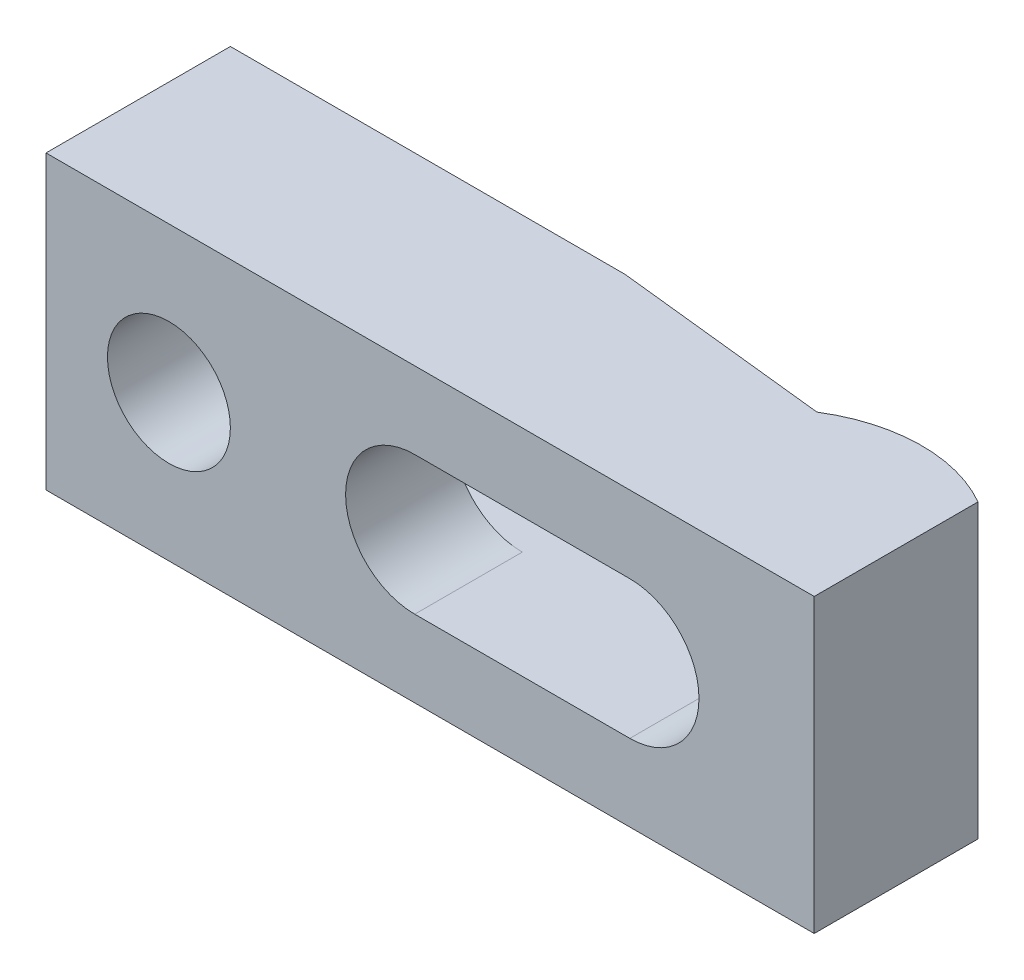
ISO-10303-21;
HEADER;
FILE_DESCRIPTION(('STEP AP214'),'2;1');
FILE_NAME('part.step','',(''),(''),'','','');
FILE_SCHEMA(('AUTOMOTIVE_DESIGN { 1 0 10303 214 1 1 1 1 }'));
ENDSEC;
DATA;
#1=APPLICATION_CONTEXT('core data for automotive mechanical design processes');
#2=APPLICATION_PROTOCOL_DEFINITION('international standard','automotive_design',2000,#1);
#3=PRODUCT_CONTEXT('',#1,'mechanical');
#4=PRODUCT('Part','Part','',(#3));
#5=PRODUCT_RELATED_PRODUCT_CATEGORY('part','',(#4));
#6=PRODUCT_DEFINITION_FORMATION('','',#4);
#7=PRODUCT_DEFINITION_CONTEXT('part definition',#1,'design');
#8=PRODUCT_DEFINITION('design','',#6,#7);
#9=PRODUCT_DEFINITION_SHAPE('','',#8);
#10=(LENGTH_UNIT() NAMED_UNIT(*) SI_UNIT(.MILLI.,.METRE.));
#11=(NAMED_UNIT(*) PLANE_ANGLE_UNIT() SI_UNIT($,.RADIAN.));
#12=(NAMED_UNIT(*) SI_UNIT($,.STERADIAN.) SOLID_ANGLE_UNIT());
#13=UNCERTAINTY_MEASURE_WITH_UNIT(LENGTH_MEASURE(1.E-05),#10,'distance_accuracy_value','');
#14=(GEOMETRIC_REPRESENTATION_CONTEXT(3) GLOBAL_UNCERTAINTY_ASSIGNED_CONTEXT((#13)) GLOBAL_UNIT_ASSIGNED_CONTEXT((#10,
#11,#12)) REPRESENTATION_CONTEXT('',''));
#15=CARTESIAN_POINT('',(0.,0.,0.));
#16=DIRECTION('',(0.,0.,1.));
#17=DIRECTION('',(1.,0.,0.));
#18=AXIS2_PLACEMENT_3D('',#15,#16,#17);
#19=CARTESIAN_POINT('',(-38.,9.5,0.));
#20=DIRECTION('',(0.,0.,-1.));
#21=DIRECTION('',(-1.,0.,0.));
#22=AXIS2_PLACEMENT_3D('',#19,#20,#21);
#23=PLANE('',#22);
#24=DIRECTION('',(1.,0.,0.));
#25=VECTOR('',#24,1.);
#26=CARTESIAN_POINT('',(-14.,4.5,0.));
#27=LINE('',#26,#25);
#28=CARTESIAN_POINT('',(-38.,4.5,0.));
#29=VERTEX_POINT('',#28);
#30=CARTESIAN_POINT('',(-12.3,4.5,0.));
#31=VERTEX_POINT('',#30);
#32=EDGE_CURVE('E127',#29,#31,#27,.T.);
#33=ORIENTED_EDGE('',*,*,#32,.F.);
#34=DIRECTION('',(0.,-1.,0.));
#35=VECTOR('',#34,1.);
#36=CARTESIAN_POINT('',(-38.,9.5,0.));
#37=LINE('',#36,#35);
#38=CARTESIAN_POINT('',(-38.,9.5,0.));
#39=VERTEX_POINT('',#38);
#40=EDGE_CURVE('E144',#39,#29,#37,.T.);
#41=ORIENTED_EDGE('',*,*,#40,.F.);
#42=DIRECTION('',(1.,0.,0.));
#43=VECTOR('',#42,1.);
#44=CARTESIAN_POINT('',(-38.,9.5,0.));
#45=LINE('',#44,#43);
#46=CARTESIAN_POINT('',(-12.3,9.5,0.));
#47=VERTEX_POINT('',#46);
#48=EDGE_CURVE('E262',#39,#47,#45,.T.);
#49=ORIENTED_EDGE('',*,*,#48,.T.);
#50=DIRECTION('',(0.,-1.,0.));
#51=VECTOR('',#50,1.);
#52=CARTESIAN_POINT('',(-12.3,9.5,0.));
#53=LINE('',#52,#51);
#54=EDGE_CURVE('E152',#47,#31,#53,.T.);
#55=ORIENTED_EDGE('',*,*,#54,.T.);
#56=EDGE_LOOP('',(#33,#41,#49,#55));
#57=FACE_BOUND('',#56,.T.);
#58=ADVANCED_FACE('F14',(#57),#23,.T.);
#59=CARTESIAN_POINT('',(-38.,9.5,12.));
#60=DIRECTION('',(-1.,0.,0.));
#61=DIRECTION('',(0.,0.,1.));
#62=AXIS2_PLACEMENT_3D('',#59,#60,#61);
#63=PLANE('',#62);
#64=ORIENTED_EDGE('',*,*,#40,.T.);
#65=DIRECTION('',(0.,0.,1.));
#66=VECTOR('',#65,1.);
#67=CARTESIAN_POINT('',(-38.,4.5,12.));
#68=LINE('',#67,#66);
#69=CARTESIAN_POINT('',(-38.,4.5,5.));
#70=VERTEX_POINT('',#69);
#71=EDGE_CURVE('E138',#29,#70,#68,.T.);
#72=ORIENTED_EDGE('',*,*,#71,.T.);
#73=DIRECTION('',(0.,-1.,0.));
#74=VECTOR('',#73,1.);
#75=CARTESIAN_POINT('',(-38.,9.5,5.));
#76=LINE('',#75,#74);
#77=CARTESIAN_POINT('',(-38.,-4.5,5.));
#78=VERTEX_POINT('',#77);
#79=EDGE_CURVE('E137',#70,#78,#76,.T.);
#80=ORIENTED_EDGE('',*,*,#79,.T.);
#81=DIRECTION('',(0.,0.,1.));
#82=VECTOR('',#81,1.);
#83=CARTESIAN_POINT('',(-38.,-4.5,12.));
#84=LINE('',#83,#82);
#85=CARTESIAN_POINT('',(-38.,-4.5,0.));
#86=VERTEX_POINT('',#85);
#87=EDGE_CURVE('E120',#86,#78,#84,.T.);
#88=ORIENTED_EDGE('',*,*,#87,.F.);
#89=CARTESIAN_POINT('',(-38.,-9.5,0.));
#90=VERTEX_POINT('',#89);
#91=EDGE_CURVE('E134',#86,#90,#37,.T.);
#92=ORIENTED_EDGE('',*,*,#91,.T.);
#93=DIRECTION('',(0.,0.,-1.));
#94=VECTOR('',#93,1.);
#95=CARTESIAN_POINT('',(-38.,-9.5,12.));
#96=LINE('',#95,#94);
#97=CARTESIAN_POINT('',(-38.,-9.5,12.));
#98=VERTEX_POINT('',#97);
#99=EDGE_CURVE('E285',#98,#90,#96,.T.);
#100=ORIENTED_EDGE('',*,*,#99,.F.);
#101=DIRECTION('',(0.,-1.,0.));
#102=VECTOR('',#101,1.);
#103=CARTESIAN_POINT('',(-38.,9.5,12.));
#104=LINE('',#103,#102);
#105=CARTESIAN_POINT('',(-38.,9.5,12.));
#106=VERTEX_POINT('',#105);
#107=EDGE_CURVE('E145',#106,#98,#104,.T.);
#108=ORIENTED_EDGE('',*,*,#107,.F.);
#109=DIRECTION('',(0.,0.,-1.));
#110=VECTOR('',#109,1.);
#111=CARTESIAN_POINT('',(-38.,9.5,12.));
#112=LINE('',#111,#110);
#113=EDGE_CURVE('E258',#106,#39,#112,.T.);
#114=ORIENTED_EDGE('',*,*,#113,.T.);
#115=EDGE_LOOP('',(#64,#72,#80,#88,#92,#100,#108,#114));
#116=FACE_BOUND('',#115,.T.);
#117=ADVANCED_FACE('F132',(#116),#63,.T.);
#118=CARTESIAN_POINT('',(-14.,0.,12.));
#119=DIRECTION('',(0.,0.,-1.));
#120=DIRECTION('',(-1.,0.,0.));
#121=AXIS2_PLACEMENT_3D('',#118,#119,#120);
#122=CYLINDRICAL_SURFACE('',#121,4.5);
#123=DIRECTION('',(0.,0.,-1.));
#124=VECTOR('',#123,1.);
#125=CARTESIAN_POINT('',(-14.,-4.5,12.));
#126=LINE('',#125,#124);
#127=CARTESIAN_POINT('',(-14.,-4.5,12.));
#128=VERTEX_POINT('',#127);
#129=CARTESIAN_POINT('',(-14.,-4.5,5.));
#130=VERTEX_POINT('',#129);
#131=EDGE_CURVE('E176',#128,#130,#126,.T.);
#132=ORIENTED_EDGE('',*,*,#131,.T.);
#133=CARTESIAN_POINT('',(-14.,0.,5.));
#134=DIRECTION('',(0.,0.,-1.));
#135=DIRECTION('',(-1.,0.,0.));
#136=AXIS2_PLACEMENT_3D('',#133,#134,#135);
#137=CIRCLE('',#136,4.5);
#138=CARTESIAN_POINT('',(-14.,4.5,5.));
#139=VERTEX_POINT('',#138);
#140=EDGE_CURVE('E300',#130,#139,#137,.T.);
#141=ORIENTED_EDGE('',*,*,#140,.T.);
#142=DIRECTION('',(0.,0.,-1.));
#143=VECTOR('',#142,1.);
#144=CARTESIAN_POINT('',(-14.,4.5,12.));
#145=LINE('',#144,#143);
#146=CARTESIAN_POINT('',(-14.,4.5,12.));
#147=VERTEX_POINT('',#146);
#148=EDGE_CURVE('E178',#147,#139,#145,.T.);
#149=ORIENTED_EDGE('',*,*,#148,.F.);
#150=CARTESIAN_POINT('',(-14.,0.,12.));
#151=DIRECTION('',(0.,0.,1.));
#152=DIRECTION('',(1.,0.,0.));
#153=AXIS2_PLACEMENT_3D('',#150,#151,#152);
#154=CIRCLE('',#153,4.5);
#155=EDGE_CURVE('E38',#147,#128,#154,.T.);
#156=ORIENTED_EDGE('',*,*,#155,.T.);
#157=EDGE_LOOP('',(#132,#141,#149,#156));
#158=FACE_BOUND('',#157,.T.);
#159=ADVANCED_FACE('F215',(#158),#122,.F.);
#160=CARTESIAN_POINT('',(-30.,0.,12.));
#161=DIRECTION('',(0.,0.,-1.));
#162=DIRECTION('',(-1.,0.,0.));
#163=AXIS2_PLACEMENT_3D('',#160,#161,#162);
#164=CYLINDRICAL_SURFACE('',#163,4.);
#165=CARTESIAN_POINT('',(-30.,0.,12.));
#166=DIRECTION('',(0.,0.,1.));
#167=DIRECTION('',(1.,0.,0.));
#168=AXIS2_PLACEMENT_3D('',#165,#166,#167);
#169=CIRCLE('',#168,4.);
#170=CARTESIAN_POINT('',(-26.,0.,12.));
#171=VERTEX_POINT('',#170);
#172=EDGE_CURVE('E254',#171,#171,#169,.T.);
#173=ORIENTED_EDGE('',*,*,#172,.T.);
#174=EDGE_LOOP('',(#173));
#175=FACE_BOUND('',#174,.T.);
#176=CARTESIAN_POINT('',(-30.,0.,5.));
#177=DIRECTION('',(0.,0.,-1.));
#178=DIRECTION('',(-1.,0.,0.));
#179=AXIS2_PLACEMENT_3D('',#176,#177,#178);
#180=CIRCLE('',#179,4.);
#181=CARTESIAN_POINT('',(-34.,0.,5.));
#182=VERTEX_POINT('',#181);
#183=EDGE_CURVE('E18',#182,#182,#180,.T.);
#184=ORIENTED_EDGE('',*,*,#183,.T.);
#185=EDGE_LOOP('',(#184));
#186=FACE_BOUND('',#185,.T.);
#187=ADVANCED_FACE('F210',(#175,#186),#164,.F.);
#188=CARTESIAN_POINT('',(12.,9.5,12.));
#189=DIRECTION('',(0.,0.,1.));
#190=DIRECTION('',(1.,0.,0.));
#191=AXIS2_PLACEMENT_3D('',#188,#189,#190);
#192=PLANE('',#191);
#193=DIRECTION('',(1.,0.,0.));
#194=VECTOR('',#193,1.);
#195=CARTESIAN_POINT('',(-14.,4.5,12.));
#196=LINE('',#195,#194);
#197=CARTESIAN_POINT('',(0.,4.5,12.));
#198=VERTEX_POINT('',#197);
#199=EDGE_CURVE('E294',#147,#198,#196,.T.);
#200=ORIENTED_EDGE('',*,*,#199,.T.);
#201=CARTESIAN_POINT('',(0.,0.,12.));
#202=DIRECTION('',(0.,0.,1.));
#203=DIRECTION('',(1.,0.,0.));
#204=AXIS2_PLACEMENT_3D('',#201,#202,#203);
#205=CIRCLE('',#204,4.5);
#206=CARTESIAN_POINT('',(0.,-4.5,12.));
#207=VERTEX_POINT('',#206);
#208=EDGE_CURVE('E126',#207,#198,#205,.T.);
#209=ORIENTED_EDGE('',*,*,#208,.F.);
#210=DIRECTION('',(-1.,0.,0.));
#211=VECTOR('',#210,1.);
#212=CARTESIAN_POINT('',(0.,-4.5,12.));
#213=LINE('',#212,#211);
#214=EDGE_CURVE('E174',#207,#128,#213,.T.);
#215=ORIENTED_EDGE('',*,*,#214,.T.);
#216=ORIENTED_EDGE('',*,*,#155,.F.);
#217=EDGE_LOOP('',(#200,#209,#215,#216));
#218=FACE_BOUND('',#217,.T.);
#219=DIRECTION('',(0.,-1.,0.));
#220=VECTOR('',#219,1.);
#221=CARTESIAN_POINT('',(12.,9.5,12.));
#222=LINE('',#221,#220);
#223=CARTESIAN_POINT('',(12.,9.5,12.));
#224=VERTEX_POINT('',#223);
#225=CARTESIAN_POINT('',(12.,-9.5,12.));
#226=VERTEX_POINT('',#225);
#227=EDGE_CURVE('E161',#224,#226,#222,.T.);
#228=ORIENTED_EDGE('',*,*,#227,.F.);
#229=DIRECTION('',(-1.,0.,0.));
#230=VECTOR('',#229,1.);
#231=CARTESIAN_POINT('',(12.,9.5,12.));
#232=LINE('',#231,#230);
#233=EDGE_CURVE('E263',#224,#106,#232,.T.);
#234=ORIENTED_EDGE('',*,*,#233,.T.);
#235=ORIENTED_EDGE('',*,*,#107,.T.);
#236=DIRECTION('',(-1.,0.,0.));
#237=VECTOR('',#236,1.);
#238=CARTESIAN_POINT('',(12.,-9.5,12.));
#239=LINE('',#238,#237);
#240=EDGE_CURVE('E198',#226,#98,#239,.T.);
#241=ORIENTED_EDGE('',*,*,#240,.F.);
#242=EDGE_LOOP('',(#228,#234,#235,#241));
#243=FACE_BOUND('',#242,.T.);
#244=ORIENTED_EDGE('',*,*,#172,.F.);
#245=EDGE_LOOP('',(#244));
#246=FACE_BOUND('',#245,.T.);
#247=ADVANCED_FACE('F228',(#218,#243,#246),#192,.T.);
#248=ORIENTED_EDGE('',*,*,#91,.F.);
#249=DIRECTION('',(-1.,0.,0.));
#250=VECTOR('',#249,1.);
#251=CARTESIAN_POINT('',(0.,-4.5,0.));
#252=LINE('',#251,#250);
#253=CARTESIAN_POINT('',(-12.3,-4.5,0.));
#254=VERTEX_POINT('',#253);
#255=EDGE_CURVE('E115',#254,#86,#252,.T.);
#256=ORIENTED_EDGE('',*,*,#255,.F.);
#257=CARTESIAN_POINT('',(-12.3,-9.5,0.));
#258=VERTEX_POINT('',#257);
#259=EDGE_CURVE('E147',#254,#258,#53,.T.);
#260=ORIENTED_EDGE('',*,*,#259,.T.);
#261=DIRECTION('',(1.,0.,0.));
#262=VECTOR('',#261,1.);
#263=CARTESIAN_POINT('',(-38.,-9.5,0.));
#264=LINE('',#263,#262);
#265=EDGE_CURVE('E143',#90,#258,#264,.T.);
#266=ORIENTED_EDGE('',*,*,#265,.F.);
#267=EDGE_LOOP('',(#248,#256,#260,#266));
#268=FACE_BOUND('',#267,.T.);
#269=ADVANCED_FACE('F141',(#268),#23,.T.);
#270=CARTESIAN_POINT('',(7.,9.5,10.));
#271=DIRECTION('',(0.,-1.,0.));
#272=DIRECTION('',(0.,0.,-1.));
#273=AXIS2_PLACEMENT_3D('',#270,#271,#272);
#274=CYLINDRICAL_SURFACE('',#273,10.);
#275=CARTESIAN_POINT('',(1.7,4.16653333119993,1.52002358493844));
#276=CARTESIAN_POINT('',(1.7999369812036,4.12577870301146,1.45754021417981));
#277=CARTESIAN_POINT('',(1.89978992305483,4.08082293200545,1.39761114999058));
#278=CARTESIAN_POINT('',(2.09832735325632,3.98236863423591,1.2829679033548));
#279=CARTESIAN_POINT('',(2.19701136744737,3.92886676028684,1.22825577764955));
#280=CARTESIAN_POINT('',(2.3921458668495,3.81320246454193,1.12419372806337));
#281=CARTESIAN_POINT('',(2.48859599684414,3.75103867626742,1.07484465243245));
#282=CARTESIAN_POINT('',(2.67812914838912,3.61815064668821,0.981542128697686));
#283=CARTESIAN_POINT('',(2.77121272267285,3.54742781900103,0.937587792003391));
#284=CARTESIAN_POINT('',(2.95321063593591,3.39742475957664,0.854863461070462));
#285=CARTESIAN_POINT('',(3.04211143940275,3.31811916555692,0.816109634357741));
#286=CARTESIAN_POINT('',(3.21437356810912,3.15153270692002,0.743771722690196));
#287=CARTESIAN_POINT('',(3.29773491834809,3.06425187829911,0.710187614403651));
#288=CARTESIAN_POINT('',(3.45785272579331,2.8823467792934,0.647964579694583));
#289=CARTESIAN_POINT('',(3.53461532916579,2.78772950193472,0.619321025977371));
#290=CARTESIAN_POINT('',(3.68073416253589,2.59174367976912,0.566627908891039));
#291=CARTESIAN_POINT('',(3.75009071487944,2.49037542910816,0.54257814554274));
#292=CARTESIAN_POINT('',(3.87809831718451,2.28568515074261,0.499573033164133));
#293=CARTESIAN_POINT('',(3.93706003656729,2.18259099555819,0.480456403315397));
#294=CARTESIAN_POINT('',(4.04687087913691,1.97154515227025,0.445820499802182));
#295=CARTESIAN_POINT('',(4.09771727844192,1.86359184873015,0.430302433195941));
#296=CARTESIAN_POINT('',(4.19080117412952,1.64360958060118,0.402564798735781));
#297=CARTESIAN_POINT('',(4.23303744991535,1.53158004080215,0.390345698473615));
#298=CARTESIAN_POINT('',(4.30852624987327,1.30420725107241,0.368929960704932));
#299=CARTESIAN_POINT('',(4.34177540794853,1.18886277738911,0.359734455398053));
#300=CARTESIAN_POINT('',(4.39915675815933,0.954990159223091,0.344094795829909));
#301=CARTESIAN_POINT('',(4.42323165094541,0.836446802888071,0.337667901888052));
#302=CARTESIAN_POINT('',(4.46177600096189,0.597651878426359,0.327471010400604));
#303=CARTESIAN_POINT('',(4.47624192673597,0.477399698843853,0.323701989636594));
#304=CARTESIAN_POINT('',(4.49542908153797,0.236126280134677,0.318717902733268));
#305=CARTESIAN_POINT('',(4.50015499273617,0.115105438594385,0.317501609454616));
#306=CARTESIAN_POINT('',(4.49983719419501,-0.126964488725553,0.317583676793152));
#307=CARTESIAN_POINT('',(4.49479007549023,-0.248013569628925,0.318882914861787));
#308=CARTESIAN_POINT('',(4.47485408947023,-0.490556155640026,0.324063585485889));
#309=CARTESIAN_POINT('',(4.45985993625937,-0.612040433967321,0.327972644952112));
#310=CARTESIAN_POINT('',(4.42005367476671,-0.853269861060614,0.3385146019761));
#311=CARTESIAN_POINT('',(4.39524158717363,-0.973015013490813,0.345147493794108));
#312=CARTESIAN_POINT('',(4.33600710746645,-1.209940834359,0.361323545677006));
#313=CARTESIAN_POINT('',(4.3015819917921,-1.32712076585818,0.37086753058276));
#314=CARTESIAN_POINT('',(4.22344823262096,-1.55798922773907,0.39310621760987));
#315=CARTESIAN_POINT('',(4.17974297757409,-1.67167901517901,0.405799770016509));
#316=CARTESIAN_POINT('',(4.08359031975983,-1.89445656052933,0.434590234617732));
#317=CARTESIAN_POINT('',(4.03116869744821,-2.0035567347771,0.450677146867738));
#318=CARTESIAN_POINT('',(3.91802621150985,-2.21666841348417,0.486590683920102));
#319=CARTESIAN_POINT('',(3.85730855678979,-2.32068186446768,0.506415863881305));
#320=CARTESIAN_POINT('',(3.72817358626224,-2.52291810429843,0.550143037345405));
#321=CARTESIAN_POINT('',(3.65975594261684,-2.62114064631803,0.574045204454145));
#322=CARTESIAN_POINT('',(3.5159772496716,-2.81106453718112,0.626237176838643));
#323=CARTESIAN_POINT('',(3.44061887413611,-2.90276837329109,0.654525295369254));
#324=CARTESIAN_POINT('',(3.28482154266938,-3.07790497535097,0.715370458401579));
#325=CARTESIAN_POINT('',(3.20446446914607,-3.16143232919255,0.747865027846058));
#326=CARTESIAN_POINT('',(3.03869026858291,-3.32108407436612,0.817619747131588));
#327=CARTESIAN_POINT('',(2.95327495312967,-3.39721109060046,0.854878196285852));
#328=CARTESIAN_POINT('',(2.77828951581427,-3.54174911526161,0.934329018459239));
#329=CARTESIAN_POINT('',(2.68871874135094,-3.610158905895,0.976522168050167));
#330=CARTESIAN_POINT('',(2.50644103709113,-3.73901212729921,1.06589479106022));
#331=CARTESIAN_POINT('',(2.41373496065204,-3.79945770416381,1.11307291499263));
#332=CARTESIAN_POINT('',(2.21825017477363,-3.91706977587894,1.21660248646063));
#333=CARTESIAN_POINT('',(2.11528023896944,-3.97353251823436,1.27339177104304));
#334=CARTESIAN_POINT('',(1.90823289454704,-4.07701664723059,1.39254611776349));
#335=CARTESIAN_POINT('',(1.80415888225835,-4.12406119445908,1.45489694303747));
#336=CARTESIAN_POINT('',(1.7,-4.16653333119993,1.52002358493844));
#337=B_SPLINE_CURVE_WITH_KNOTS('',3,(#275,#276,#277,#278,#279,#280,#281,#282,#283,#284,#285,
#286,#287,#288,#289,#290,#291,#292,#293,#294,#295,#296,#297,#298,#299,#300,#301,#302,#303,#304,
#305,#306,#307,#308,#309,#310,#311,#312,#313,#314,#315,#316,#317,#318,#319,#320,#321,#322,#323,
#324,#325,#326,#327,#328,#329,#330,#331,#332,#333,#334,#335,#336),.UNSPECIFIED.,.F.,.F.,(4,2,2,
2,2,2,2,2,2,2,2,2,2,2,2,2,2,2,2,2,2,2,2,2,2,2,2,2,2,2,4),(0.,0.374072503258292,
0.748291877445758,1.12257035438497,1.49678709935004,1.87214152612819,2.24749425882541,
2.62249350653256,2.99747642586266,3.35793055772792,3.71850542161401,4.0791313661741,
4.4398921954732,4.80287066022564,5.16598245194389,5.52891964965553,5.89198346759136,
6.25895284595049,6.62592145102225,6.99299413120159,7.35993301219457,7.72580529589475,
8.09153645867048,8.45728319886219,8.8228896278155,9.18358296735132,9.54414789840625,
9.90476964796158,10.2652940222,10.6561508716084,11.0460344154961),.UNSPECIFIED.);
#338=CARTESIAN_POINT('',(1.7,4.16653333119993,1.52002358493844));
#339=VERTEX_POINT('',#338);
#340=CARTESIAN_POINT('',(1.7,-4.16653333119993,1.52002358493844));
#341=VERTEX_POINT('',#340);
#342=EDGE_CURVE('E170',#339,#341,#337,.T.);
#343=ORIENTED_EDGE('',*,*,#342,.F.);
#344=DIRECTION('',(0.,-1.,0.));
#345=VECTOR('',#344,1.);
#346=CARTESIAN_POINT('',(1.7,9.5,1.52002358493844));
#347=LINE('',#346,#345);
#348=CARTESIAN_POINT('',(1.7,9.5,1.52002358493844));
#349=VERTEX_POINT('',#348);
#350=EDGE_CURVE('E156',#349,#339,#347,.T.);
#351=ORIENTED_EDGE('',*,*,#350,.F.);
#352=CARTESIAN_POINT('',(7.,9.5,10.));
#353=DIRECTION('',(0.,1.,0.));
#354=DIRECTION('',(0.,0.,1.));
#355=AXIS2_PLACEMENT_3D('',#352,#353,#354);
#356=CIRCLE('',#355,10.);
#357=CARTESIAN_POINT('',(12.,9.5,1.33974596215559));
#358=VERTEX_POINT('',#357);
#359=EDGE_CURVE('E270',#358,#349,#356,.T.);
#360=ORIENTED_EDGE('',*,*,#359,.F.);
#361=DIRECTION('',(0.,-1.,0.));
#362=VECTOR('',#361,1.);
#363=CARTESIAN_POINT('',(12.,9.5,1.33974596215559));
#364=LINE('',#363,#362);
#365=CARTESIAN_POINT('',(12.,-9.5,1.33974596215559));
#366=VERTEX_POINT('',#365);
#367=EDGE_CURVE('E159',#358,#366,#364,.T.);
#368=ORIENTED_EDGE('',*,*,#367,.T.);
#369=CARTESIAN_POINT('',(7.,-9.5,10.));
#370=DIRECTION('',(0.,1.,0.));
#371=DIRECTION('',(0.,0.,1.));
#372=AXIS2_PLACEMENT_3D('',#369,#370,#371);
#373=CIRCLE('',#372,10.);
#374=CARTESIAN_POINT('',(1.7,-9.5,1.52002358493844));
#375=VERTEX_POINT('',#374);
#376=EDGE_CURVE('E275',#366,#375,#373,.T.);
#377=ORIENTED_EDGE('',*,*,#376,.T.);
#378=EDGE_CURVE('E155',#341,#375,#347,.T.);
#379=ORIENTED_EDGE('',*,*,#378,.F.);
#380=EDGE_LOOP('',(#343,#351,#360,#368,#377,#379));
#381=FACE_BOUND('',#380,.T.);
#382=ADVANCED_FACE('F201',(#381),#274,.T.);
#383=CARTESIAN_POINT('',(1.7,9.5,1.52002358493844));
#384=DIRECTION('',(-0.107938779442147,0.,0.994157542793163));
#385=DIRECTION('',(0.994157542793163,0.,0.107938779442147));
#386=AXIS2_PLACEMENT_3D('',#383,#384,#385);
#387=PLANE('',#386);
#388=CARTESIAN_POINT('',(0.,0.,1.33544929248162));
#389=DIRECTION('',(-0.107938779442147,0.,0.994157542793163));
#390=DIRECTION('',(-0.994157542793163,0.,-0.107938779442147));
#391=AXIS2_PLACEMENT_3D('',#388,#389,#390);
#392=ELLIPSE('',#391,4.52644556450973,4.5);
#393=CARTESIAN_POINT('',(0.,4.5,1.33544929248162));
#394=VERTEX_POINT('',#393);
#395=EDGE_CURVE('E9',#394,#339,#392,.F.);
#396=ORIENTED_EDGE('',*,*,#395,.F.);
#397=DIRECTION('',(-0.994157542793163,0.,-0.107938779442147));
#398=VECTOR('',#397,1.);
#399=CARTESIAN_POINT('',(1.7,4.5,1.52002358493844));
#400=LINE('',#399,#398);
#401=EDGE_CURVE('E190',#394,#31,#400,.T.);
#402=ORIENTED_EDGE('',*,*,#401,.T.);
#403=ORIENTED_EDGE('',*,*,#54,.F.);
#404=DIRECTION('',(-0.994157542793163,0.,-0.107938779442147));
#405=VECTOR('',#404,1.);
#406=CARTESIAN_POINT('',(1.7,9.5,1.52002358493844));
#407=LINE('',#406,#405);
#408=EDGE_CURVE('E268',#349,#47,#407,.T.);
#409=ORIENTED_EDGE('',*,*,#408,.F.);
#410=ORIENTED_EDGE('',*,*,#350,.T.);
#411=EDGE_LOOP('',(#396,#402,#403,#409,#410));
#412=FACE_BOUND('',#411,.T.);
#413=ADVANCED_FACE('F235',(#412),#387,.F.);
#414=CARTESIAN_POINT('',(0.,-4.5,1.33544929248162));
#415=VERTEX_POINT('',#414);
#416=EDGE_CURVE('E23',#341,#415,#392,.F.);
#417=ORIENTED_EDGE('',*,*,#416,.F.);
#418=ORIENTED_EDGE('',*,*,#378,.T.);
#419=DIRECTION('',(-0.994157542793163,0.,-0.107938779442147));
#420=VECTOR('',#419,1.);
#421=CARTESIAN_POINT('',(1.7,-9.5,1.52002358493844));
#422=LINE('',#421,#420);
#423=EDGE_CURVE('E279',#375,#258,#422,.T.);
#424=ORIENTED_EDGE('',*,*,#423,.T.);
#425=ORIENTED_EDGE('',*,*,#259,.F.);
#426=DIRECTION('',(0.994157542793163,0.,0.107938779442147));
#427=VECTOR('',#426,1.);
#428=CARTESIAN_POINT('',(1.7,-4.5,1.52002358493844));
#429=LINE('',#428,#427);
#430=EDGE_CURVE('E122',#254,#415,#429,.T.);
#431=ORIENTED_EDGE('',*,*,#430,.T.);
#432=EDGE_LOOP('',(#417,#418,#424,#425,#431));
#433=FACE_BOUND('',#432,.T.);
#434=ADVANCED_FACE('F237',(#433),#387,.F.);
#435=CARTESIAN_POINT('',(12.,9.5,12.));
#436=DIRECTION('',(-1.,0.,0.));
#437=DIRECTION('',(0.,0.,1.));
#438=AXIS2_PLACEMENT_3D('',#435,#436,#437);
#439=PLANE('',#438);
#440=ORIENTED_EDGE('',*,*,#367,.F.);
#441=DIRECTION('',(0.,0.,-1.));
#442=VECTOR('',#441,1.);
#443=CARTESIAN_POINT('',(12.,9.5,12.));
#444=LINE('',#443,#442);
#445=EDGE_CURVE('E148',#224,#358,#444,.T.);
#446=ORIENTED_EDGE('',*,*,#445,.F.);
#447=ORIENTED_EDGE('',*,*,#227,.T.);
#448=DIRECTION('',(0.,0.,-1.));
#449=VECTOR('',#448,1.);
#450=CARTESIAN_POINT('',(12.,-9.5,12.));
#451=LINE('',#450,#449);
#452=EDGE_CURVE('E199',#226,#366,#451,.T.);
#453=ORIENTED_EDGE('',*,*,#452,.T.);
#454=EDGE_LOOP('',(#440,#446,#447,#453));
#455=FACE_BOUND('',#454,.T.);
#456=ADVANCED_FACE('F16',(#455),#439,.F.);
#457=CARTESIAN_POINT('',(7.,9.5,10.));
#458=DIRECTION('',(0.,1.,0.));
#459=DIRECTION('',(0.,0.,1.));
#460=AXIS2_PLACEMENT_3D('',#457,#458,#459);
#461=PLANE('',#460);
#462=ORIENTED_EDGE('',*,*,#233,.F.);
#463=ORIENTED_EDGE('',*,*,#445,.T.);
#464=ORIENTED_EDGE('',*,*,#359,.T.);
#465=ORIENTED_EDGE('',*,*,#408,.T.);
#466=ORIENTED_EDGE('',*,*,#48,.F.);
#467=ORIENTED_EDGE('',*,*,#113,.F.);
#468=EDGE_LOOP('',(#462,#463,#464,#465,#466,#467));
#469=FACE_BOUND('',#468,.T.);
#470=ADVANCED_FACE('F223',(#469),#461,.T.);
#471=CARTESIAN_POINT('',(7.,-9.5,10.));
#472=DIRECTION('',(0.,1.,0.));
#473=DIRECTION('',(0.,0.,1.));
#474=AXIS2_PLACEMENT_3D('',#471,#472,#473);
#475=PLANE('',#474);
#476=ORIENTED_EDGE('',*,*,#240,.T.);
#477=ORIENTED_EDGE('',*,*,#99,.T.);
#478=ORIENTED_EDGE('',*,*,#265,.T.);
#479=ORIENTED_EDGE('',*,*,#423,.F.);
#480=ORIENTED_EDGE('',*,*,#376,.F.);
#481=ORIENTED_EDGE('',*,*,#452,.F.);
#482=EDGE_LOOP('',(#476,#477,#478,#479,#480,#481));
#483=FACE_BOUND('',#482,.T.);
#484=ADVANCED_FACE('F209',(#483),#475,.F.);
#485=CARTESIAN_POINT('',(0.,0.,12.));
#486=DIRECTION('',(0.,0.,-1.));
#487=DIRECTION('',(-1.,0.,0.));
#488=AXIS2_PLACEMENT_3D('',#485,#486,#487);
#489=CYLINDRICAL_SURFACE('',#488,4.5);
#490=ORIENTED_EDGE('',*,*,#395,.T.);
#491=ORIENTED_EDGE('',*,*,#342,.T.);
#492=ORIENTED_EDGE('',*,*,#416,.T.);
#493=DIRECTION('',(0.,0.,-1.));
#494=VECTOR('',#493,1.);
#495=CARTESIAN_POINT('',(0.,-4.5,12.));
#496=LINE('',#495,#494);
#497=EDGE_CURVE('E167',#207,#415,#496,.T.);
#498=ORIENTED_EDGE('',*,*,#497,.F.);
#499=ORIENTED_EDGE('',*,*,#208,.T.);
#500=DIRECTION('',(0.,0.,-1.));
#501=VECTOR('',#500,1.);
#502=CARTESIAN_POINT('',(0.,4.5,12.));
#503=LINE('',#502,#501);
#504=EDGE_CURVE('E186',#198,#394,#503,.T.);
#505=ORIENTED_EDGE('',*,*,#504,.T.);
#506=EDGE_LOOP('',(#490,#491,#492,#498,#499,#505));
#507=FACE_BOUND('',#506,.T.);
#508=ADVANCED_FACE('F165',(#507),#489,.F.);
#509=CARTESIAN_POINT('',(-14.,4.5,12.));
#510=DIRECTION('',(0.,1.,0.));
#511=DIRECTION('',(-1.,0.,0.));
#512=AXIS2_PLACEMENT_3D('',#509,#510,#511);
#513=PLANE('',#512);
#514=ORIENTED_EDGE('',*,*,#32,.T.);
#515=ORIENTED_EDGE('',*,*,#401,.F.);
#516=ORIENTED_EDGE('',*,*,#504,.F.);
#517=ORIENTED_EDGE('',*,*,#199,.F.);
#518=ORIENTED_EDGE('',*,*,#148,.T.);
#519=DIRECTION('',(-1.,0.,0.));
#520=VECTOR('',#519,1.);
#521=CARTESIAN_POINT('',(-8.,4.5,5.));
#522=LINE('',#521,#520);
#523=EDGE_CURVE('E30',#139,#70,#522,.T.);
#524=ORIENTED_EDGE('',*,*,#523,.T.);
#525=ORIENTED_EDGE('',*,*,#71,.F.);
#526=EDGE_LOOP('',(#514,#515,#516,#517,#518,#524,#525));
#527=FACE_BOUND('',#526,.T.);
#528=ADVANCED_FACE('F208',(#527),#513,.F.);
#529=CARTESIAN_POINT('',(0.,-4.5,12.));
#530=DIRECTION('',(0.,-1.,0.));
#531=DIRECTION('',(1.,0.,0.));
#532=AXIS2_PLACEMENT_3D('',#529,#530,#531);
#533=PLANE('',#532);
#534=ORIENTED_EDGE('',*,*,#497,.T.);
#535=ORIENTED_EDGE('',*,*,#430,.F.);
#536=ORIENTED_EDGE('',*,*,#255,.T.);
#537=ORIENTED_EDGE('',*,*,#87,.T.);
#538=DIRECTION('',(-1.,0.,0.));
#539=VECTOR('',#538,1.);
#540=CARTESIAN_POINT('',(-8.,-4.5,5.));
#541=LINE('',#540,#539);
#542=EDGE_CURVE('E302',#130,#78,#541,.T.);
#543=ORIENTED_EDGE('',*,*,#542,.F.);
#544=ORIENTED_EDGE('',*,*,#131,.F.);
#545=ORIENTED_EDGE('',*,*,#214,.F.);
#546=EDGE_LOOP('',(#534,#535,#536,#537,#543,#544,#545));
#547=FACE_BOUND('',#546,.T.);
#548=ADVANCED_FACE('F118',(#547),#533,.F.);
#549=CARTESIAN_POINT('',(-8.,-4.5,5.));
#550=DIRECTION('',(0.,0.,-1.));
#551=DIRECTION('',(-1.,0.,0.));
#552=AXIS2_PLACEMENT_3D('',#549,#550,#551);
#553=PLANE('',#552);
#554=ORIENTED_EDGE('',*,*,#183,.F.);
#555=EDGE_LOOP('',(#554));
#556=FACE_BOUND('',#555,.T.);
#557=ORIENTED_EDGE('',*,*,#523,.F.);
#558=ORIENTED_EDGE('',*,*,#140,.F.);
#559=ORIENTED_EDGE('',*,*,#542,.T.);
#560=ORIENTED_EDGE('',*,*,#79,.F.);
#561=EDGE_LOOP('',(#557,#558,#559,#560));
#562=FACE_BOUND('',#561,.T.);
#563=ADVANCED_FACE('F214',(#556,#562),#553,.T.);
#564=CLOSED_SHELL('',(#58,#117,#159,#187,#247,#269,#382,#413,#434,#456,#470,#484,#508,#528,#548,#563));
#565=MANIFOLD_SOLID_BREP('B1',#564);
#566=ADVANCED_BREP_SHAPE_REPRESENTATION('',(#18,#565),#14);
#567=SHAPE_DEFINITION_REPRESENTATION(#9,#566);
ENDSEC;
END-ISO-10303-21;
